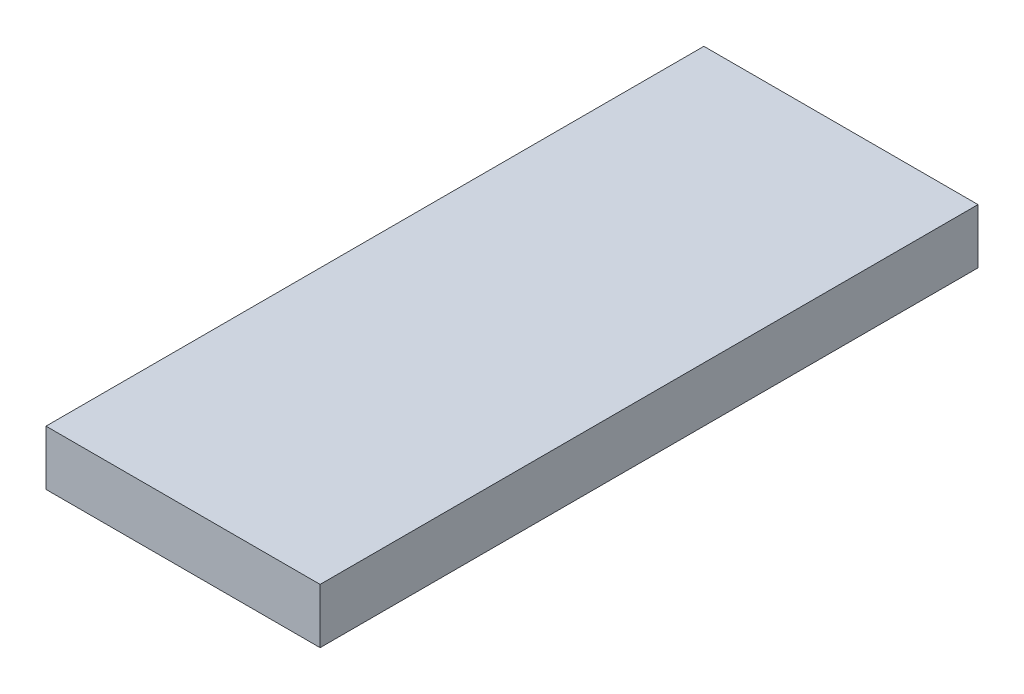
from build123d import *

# Parameters (mm, degrees)
ESQUISSE1_W        = 25
ESQUISSE1_H        = 5
BOSS_EXTRU_1_DEPTH = 60


with BuildPart() as part:
    # Esquisse1 → Boss.-Extru.1 (new body)
    with BuildSketch(Plane.XY):
        Rectangle(ESQUISSE1_W, ESQUISSE1_H)
    extrude(amount=BOSS_EXTRU_1_DEPTH)


solid = part.part
